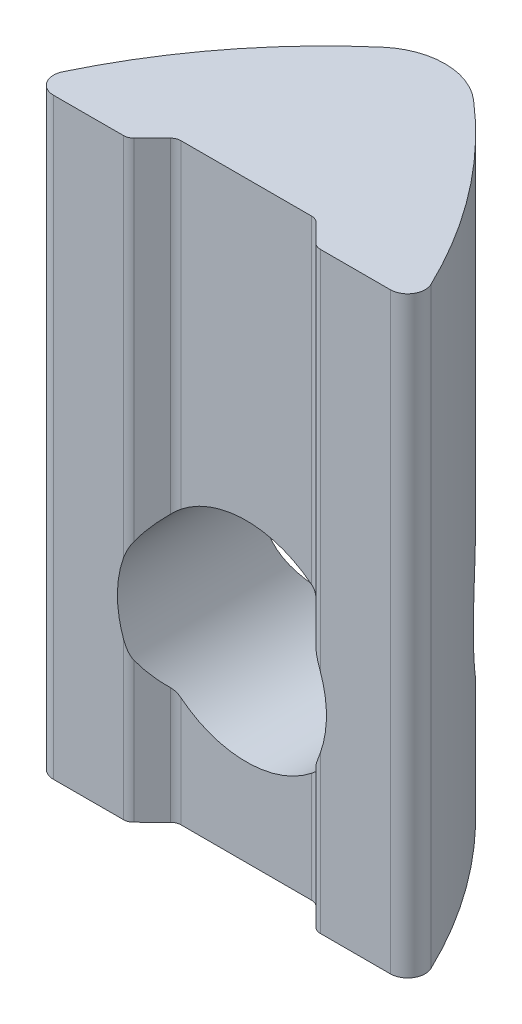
ISO-10303-21;
HEADER;
FILE_DESCRIPTION(('STEP AP214'),'2;1');
FILE_NAME('part.step','',(''),(''),'','','');
FILE_SCHEMA(('AUTOMOTIVE_DESIGN { 1 0 10303 214 1 1 1 1 }'));
ENDSEC;
DATA;
#1=APPLICATION_CONTEXT('core data for automotive mechanical design processes');
#2=APPLICATION_PROTOCOL_DEFINITION('international standard','automotive_design',2000,#1);
#3=PRODUCT_CONTEXT('',#1,'mechanical');
#4=PRODUCT('Part','Part','',(#3));
#5=PRODUCT_RELATED_PRODUCT_CATEGORY('part','',(#4));
#6=PRODUCT_DEFINITION_FORMATION('','',#4);
#7=PRODUCT_DEFINITION_CONTEXT('part definition',#1,'design');
#8=PRODUCT_DEFINITION('design','',#6,#7);
#9=PRODUCT_DEFINITION_SHAPE('','',#8);
#10=(LENGTH_UNIT() NAMED_UNIT(*) SI_UNIT(.MILLI.,.METRE.));
#11=(NAMED_UNIT(*) PLANE_ANGLE_UNIT() SI_UNIT($,.RADIAN.));
#12=(NAMED_UNIT(*) SI_UNIT($,.STERADIAN.) SOLID_ANGLE_UNIT());
#13=UNCERTAINTY_MEASURE_WITH_UNIT(LENGTH_MEASURE(1.E-05),#10,'distance_accuracy_value','');
#14=(GEOMETRIC_REPRESENTATION_CONTEXT(3) GLOBAL_UNCERTAINTY_ASSIGNED_CONTEXT((#13)) GLOBAL_UNIT_ASSIGNED_CONTEXT((#10,
#11,#12)) REPRESENTATION_CONTEXT('',''));
#15=CARTESIAN_POINT('',(0.,0.,0.));
#16=DIRECTION('',(0.,0.,1.));
#17=DIRECTION('',(1.,0.,0.));
#18=AXIS2_PLACEMENT_3D('',#15,#16,#17);
#19=CARTESIAN_POINT('',(-2.61216581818,11.5,-0.0902734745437));
#20=DIRECTION('',(0.70558446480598,0.,0.70862582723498));
#21=DIRECTION('',(0.70862582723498,0.,-0.70558446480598));
#22=AXIS2_PLACEMENT_3D('',#19,#20,#21);
#23=PLANE('',#22);
#24=DIRECTION('',(0.70862582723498,0.,-0.70558446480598));
#25=VECTOR('',#24,1.);
#26=CARTESIAN_POINT('',(-2.61216581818,11.5,-0.0902734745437));
#27=LINE('',#26,#25);
#28=CARTESIAN_POINT('',(-2.08760015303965,11.5,-0.612587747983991));
#29=VERTEX_POINT('',#28);
#30=CARTESIAN_POINT('',(-2.6121658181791,11.5,-0.0902734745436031));
#31=VERTEX_POINT('',#30);
#32=EDGE_CURVE('E184',#29,#31,#27,.F.);
#33=ORIENTED_EDGE('',*,*,#32,.T.);
#34=DIRECTION('',(0.,-1.,0.));
#35=VECTOR('',#34,1.);
#36=CARTESIAN_POINT('',(-2.61216581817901,11.5,-0.0902734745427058));
#37=LINE('',#36,#35);
#38=CARTESIAN_POINT('',(-2.61216581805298,1.47532699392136,-0.0902734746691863));
#39=VERTEX_POINT('',#38);
#40=EDGE_CURVE('E182',#39,#31,#37,.F.);
#41=ORIENTED_EDGE('',*,*,#40,.F.);
#42=CARTESIAN_POINT('',(0.,0.,-2.69122809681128));
#43=DIRECTION('',(0.70558446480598,0.,0.70862582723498));
#44=DIRECTION('',(-0.70862582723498,0.,0.70558446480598));
#45=AXIS2_PLACEMENT_3D('',#42,#43,#44);
#46=ELLIPSE('',#45,4.23354594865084,3.);
#47=CARTESIAN_POINT('',(-2.08760015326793,2.15451284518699,-0.612587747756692));
#48=VERTEX_POINT('',#47);
#49=EDGE_CURVE('E20',#39,#48,#46,.F.);
#50=ORIENTED_EDGE('',*,*,#49,.T.);
#51=DIRECTION('',(0.,-1.,0.));
#52=VECTOR('',#51,1.);
#53=CARTESIAN_POINT('',(-2.08760015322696,11.5,-0.612587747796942));
#54=LINE('',#53,#52);
#55=EDGE_CURVE('E179',#48,#29,#54,.F.);
#56=ORIENTED_EDGE('',*,*,#55,.T.);
#57=EDGE_LOOP('',(#33,#41,#50,#56));
#58=FACE_BOUND('',#57,.T.);
#59=ADVANCED_FACE('F17',(#58),#23,.T.);
#60=CARTESIAN_POINT('',(-2.61216581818,11.5,-0.0902734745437));
#61=DIRECTION('',(0.70558446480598,0.,0.70862582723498));
#62=DIRECTION('',(0.70862582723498,0.,-0.70558446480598));
#63=AXIS2_PLACEMENT_3D('',#60,#61,#62);
#64=PLANE('',#63);
#65=DIRECTION('',(0.70862582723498,0.,-0.70558446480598));
#66=VECTOR('',#65,1.);
#67=CARTESIAN_POINT('',(-2.61216581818,-5.5,-0.0902734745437));
#68=LINE('',#67,#66);
#69=CARTESIAN_POINT('',(-2.61216581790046,-5.5,-0.0902734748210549));
#70=VERTEX_POINT('',#69);
#71=CARTESIAN_POINT('',(-2.08760015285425,-5.5,-0.612587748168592));
#72=VERTEX_POINT('',#71);
#73=EDGE_CURVE('E378',#70,#72,#68,.T.);
#74=ORIENTED_EDGE('',*,*,#73,.T.);
#75=DIRECTION('',(0.,-1.,0.));
#76=VECTOR('',#75,1.);
#77=CARTESIAN_POINT('',(-2.08760015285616,11.5,-0.612587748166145));
#78=LINE('',#77,#76);
#79=CARTESIAN_POINT('',(-2.08760015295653,-2.15451284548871,-0.612587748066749));
#80=VERTEX_POINT('',#79);
#81=EDGE_CURVE('E460',#72,#80,#78,.F.);
#82=ORIENTED_EDGE('',*,*,#81,.T.);
#83=CARTESIAN_POINT('',(0.,0.,-2.69122809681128));
#84=DIRECTION('',(0.70558446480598,0.,0.70862582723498));
#85=DIRECTION('',(-0.70862582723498,0.,0.70558446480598));
#86=AXIS2_PLACEMENT_3D('',#83,#84,#85);
#87=ELLIPSE('',#86,4.23354594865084,3.);
#88=CARTESIAN_POINT('',(-2.61216581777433,-1.4753269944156,-0.0902734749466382));
#89=VERTEX_POINT('',#88);
#90=EDGE_CURVE('E381',#80,#89,#87,.F.);
#91=ORIENTED_EDGE('',*,*,#90,.T.);
#92=DIRECTION('',(0.,-1.,0.));
#93=VECTOR('',#92,1.);
#94=CARTESIAN_POINT('',(-2.61216581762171,11.5,-0.0902734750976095));
#95=LINE('',#94,#93);
#96=EDGE_CURVE('E453',#70,#89,#95,.F.);
#97=ORIENTED_EDGE('',*,*,#96,.F.);
#98=EDGE_LOOP('',(#74,#82,#91,#97));
#99=FACE_BOUND('',#98,.T.);
#100=ADVANCED_FACE('F477',(#99),#64,.T.);
#101=CARTESIAN_POINT('',(2.08805684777,11.5,-0.612132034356));
#102=DIRECTION('',(-0.707106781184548,0.,0.707106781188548));
#103=DIRECTION('',(0.707106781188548,0.,0.707106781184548));
#104=AXIS2_PLACEMENT_3D('',#101,#102,#103);
#105=PLANE('',#104);
#106=DIRECTION('',(0.707106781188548,0.,0.707106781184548));
#107=VECTOR('',#106,1.);
#108=CARTESIAN_POINT('',(2.08805684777,-5.5,-0.612132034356));
#109=LINE('',#108,#107);
#110=CARTESIAN_POINT('',(2.08805684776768,-5.5,-0.612132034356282));
#111=VERTEX_POINT('',#110);
#112=CARTESIAN_POINT('',(2.61232091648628,-5.5,-0.0878679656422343));
#113=VERTEX_POINT('',#112);
#114=EDGE_CURVE('E375',#111,#113,#109,.T.);
#115=ORIENTED_EDGE('',*,*,#114,.T.);
#116=DIRECTION('',(0.,-1.,0.));
#117=VECTOR('',#116,1.);
#118=CARTESIAN_POINT('',(2.61232091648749,11.5,-0.0878679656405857));
#119=LINE('',#118,#117);
#120=CARTESIAN_POINT('',(2.61232091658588,-1.47505234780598,-0.0878679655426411));
#121=VERTEX_POINT('',#120);
#122=EDGE_CURVE('E449',#121,#113,#119,.T.);
#123=ORIENTED_EDGE('',*,*,#122,.F.);
#124=CARTESIAN_POINT('',(0.,0.,-2.70018888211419));
#125=DIRECTION('',(-0.707106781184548,0.,0.707106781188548));
#126=DIRECTION('',(0.707106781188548,0.,0.707106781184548));
#127=AXIS2_PLACEMENT_3D('',#124,#125,#126);
#128=ELLIPSE('',#127,4.24264068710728,3.);
#129=CARTESIAN_POINT('',(2.08805684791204,-2.15407024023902,-0.612132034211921));
#130=VERTEX_POINT('',#129);
#131=EDGE_CURVE('E377',#121,#130,#128,.F.);
#132=ORIENTED_EDGE('',*,*,#131,.T.);
#133=DIRECTION('',(0.,-1.,0.));
#134=VECTOR('',#133,1.);
#135=CARTESIAN_POINT('',(2.08805684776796,11.5,-0.612132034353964));
#136=LINE('',#135,#134);
#137=EDGE_CURVE('E458',#130,#111,#136,.T.);
#138=ORIENTED_EDGE('',*,*,#137,.T.);
#139=EDGE_LOOP('',(#115,#123,#132,#138));
#140=FACE_BOUND('',#139,.T.);
#141=ADVANCED_FACE('F475',(#140),#105,.T.);
#142=CARTESIAN_POINT('',(2.08805684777,11.5,-0.612132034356));
#143=DIRECTION('',(-0.707106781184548,0.,0.707106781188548));
#144=DIRECTION('',(0.707106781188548,0.,0.707106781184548));
#145=AXIS2_PLACEMENT_3D('',#142,#143,#144);
#146=PLANE('',#145);
#147=DIRECTION('',(0.707106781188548,0.,0.707106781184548));
#148=VECTOR('',#147,1.);
#149=CARTESIAN_POINT('',(2.08805684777,11.5,-0.612132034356));
#150=LINE('',#149,#148);
#151=CARTESIAN_POINT('',(2.61232091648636,11.5,-0.0878679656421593));
#152=VERTEX_POINT('',#151);
#153=CARTESIAN_POINT('',(2.08805684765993,11.5,-0.612132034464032));
#154=VERTEX_POINT('',#153);
#155=EDGE_CURVE('E353',#152,#154,#150,.F.);
#156=ORIENTED_EDGE('',*,*,#155,.T.);
#157=DIRECTION('',(0.,-1.,0.));
#158=VECTOR('',#157,1.);
#159=CARTESIAN_POINT('',(2.08805684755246,11.5,-0.612132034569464));
#160=LINE('',#159,#158);
#161=CARTESIAN_POINT('',(2.08805684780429,2.15407024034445,-0.612132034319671));
#162=VERTEX_POINT('',#161);
#163=EDGE_CURVE('E360',#154,#162,#160,.T.);
#164=ORIENTED_EDGE('',*,*,#163,.T.);
#165=CARTESIAN_POINT('',(0.,0.,-2.70018888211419));
#166=DIRECTION('',(-0.707106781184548,0.,0.707106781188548));
#167=DIRECTION('',(0.707106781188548,0.,0.707106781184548));
#168=AXIS2_PLACEMENT_3D('',#165,#166,#167);
#169=ELLIPSE('',#168,4.24264068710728,3.);
#170=CARTESIAN_POINT('',(2.61232091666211,1.47505234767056,-0.0878679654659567));
#171=VERTEX_POINT('',#170);
#172=EDGE_CURVE('E370',#162,#171,#169,.F.);
#173=ORIENTED_EDGE('',*,*,#172,.T.);
#174=DIRECTION('',(0.,-1.,0.));
#175=VECTOR('',#174,1.);
#176=CARTESIAN_POINT('',(2.61232091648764,11.5,-0.0878679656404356));
#177=LINE('',#176,#175);
#178=EDGE_CURVE('E368',#152,#171,#177,.T.);
#179=ORIENTED_EDGE('',*,*,#178,.F.);
#180=EDGE_LOOP('',(#156,#164,#173,#179));
#181=FACE_BOUND('',#180,.T.);
#182=ADVANCED_FACE('F364',(#181),#146,.T.);
#183=CARTESIAN_POINT('',(1.87592481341,11.5,-0.4));
#184=DIRECTION('',(0.,-1.,0.));
#185=DIRECTION('',(0.,0.,-1.));
#186=AXIS2_PLACEMENT_3D('',#183,#184,#185);
#187=CYLINDRICAL_SURFACE('',#186,0.3);
#188=ORIENTED_EDGE('',*,*,#163,.F.);
#189=CARTESIAN_POINT('',(1.87592481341,11.5,-0.4));
#190=DIRECTION('',(0.,-1.,0.));
#191=DIRECTION('',(0.,0.,-1.));
#192=AXIS2_PLACEMENT_3D('',#189,#190,#191);
#193=CIRCLE('',#192,0.3);
#194=CARTESIAN_POINT('',(1.87592481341,11.5,-0.7));
#195=VERTEX_POINT('',#194);
#196=EDGE_CURVE('E351',#195,#154,#193,.T.);
#197=ORIENTED_EDGE('',*,*,#196,.F.);
#198=DIRECTION('',(0.,1.,0.));
#199=VECTOR('',#198,1.);
#200=CARTESIAN_POINT('',(1.87592481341,11.5,-0.7));
#201=LINE('',#200,#199);
#202=CARTESIAN_POINT('',(1.87592481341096,2.34113350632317,-0.6999999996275));
#203=VERTEX_POINT('',#202);
#204=EDGE_CURVE('E198',#203,#195,#201,.T.);
#205=ORIENTED_EDGE('',*,*,#204,.F.);
#206=CARTESIAN_POINT('',(2.0880568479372,2.15407024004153,-0.612132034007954));
#207=CARTESIAN_POINT('',(2.07296823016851,2.16871077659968,-0.627162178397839));
#208=CARTESIAN_POINT('',(2.05676984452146,2.1840914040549,-0.640217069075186));
#209=CARTESIAN_POINT('',(2.02304932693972,2.21534908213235,-0.662212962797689));
#210=CARTESIAN_POINT('',(2.00556719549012,2.23120600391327,-0.671243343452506));
#211=CARTESIAN_POINT('',(1.97000037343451,2.26266348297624,-0.685488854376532));
#212=CARTESIAN_POINT('',(1.95195306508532,2.27825591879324,-0.690817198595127));
#213=CARTESIAN_POINT('',(1.9146635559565,2.30969315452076,-0.698104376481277));
#214=CARTESIAN_POINT('',(1.89540333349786,2.32553539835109,-0.69998202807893));
#215=CARTESIAN_POINT('',(1.87592481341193,2.3411335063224,-0.7));
#216=B_SPLINE_CURVE_WITH_KNOTS('',3,(#206,#207,#208,#209,#210,#211,#212,#213,#214,#215),
.UNSPECIFIED.,.F.,.F.,(4,2,2,2,4),(0.,0.0773051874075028,0.152795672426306,0.225861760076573,
0.300625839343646),.UNSPECIFIED.);
#217=EDGE_CURVE('E192',#162,#203,#216,.T.);
#218=ORIENTED_EDGE('',*,*,#217,.F.);
#219=EDGE_LOOP('',(#188,#197,#205,#218));
#220=FACE_BOUND('',#219,.T.);
#221=ADVANCED_FACE('F323',(#220),#187,.F.);
#222=CARTESIAN_POINT('',(-1.87592481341,11.5,-0.4));
#223=DIRECTION('',(0.,-1.,0.));
#224=DIRECTION('',(0.,0.,-1.));
#225=AXIS2_PLACEMENT_3D('',#222,#223,#224);
#226=CYLINDRICAL_SURFACE('',#225,0.3);
#227=DIRECTION('',(0.,1.,0.));
#228=VECTOR('',#227,1.);
#229=CARTESIAN_POINT('',(-1.87592481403,11.5,-0.7));
#230=LINE('',#229,#228);
#231=CARTESIAN_POINT('',(-1.87592481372,11.5,-0.7));
#232=VERTEX_POINT('',#231);
#233=CARTESIAN_POINT('',(-1.87592481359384,2.34113350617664,-0.7));
#234=VERTEX_POINT('',#233);
#235=EDGE_CURVE('E202',#232,#234,#230,.F.);
#236=ORIENTED_EDGE('',*,*,#235,.F.);
#237=CARTESIAN_POINT('',(-1.87592481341,11.5,-0.4));
#238=DIRECTION('',(0.,-1.,0.));
#239=DIRECTION('',(0.,0.,-1.));
#240=AXIS2_PLACEMENT_3D('',#237,#238,#239);
#241=CIRCLE('',#240,0.3);
#242=EDGE_CURVE('E191',#29,#232,#241,.T.);
#243=ORIENTED_EDGE('',*,*,#242,.F.);
#244=ORIENTED_EDGE('',*,*,#55,.F.);
#245=CARTESIAN_POINT('',(-2.08760015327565,2.1545128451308,-0.612587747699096));
#246=CARTESIAN_POINT('',(-2.07248942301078,2.16916859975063,-0.627575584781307));
#247=CARTESIAN_POINT('',(-2.05627249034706,2.18455983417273,-0.640590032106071));
#248=CARTESIAN_POINT('',(-2.02251969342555,2.21583280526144,-0.662508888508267));
#249=CARTESIAN_POINT('',(-2.0050235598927,2.23169464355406,-0.6715023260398));
#250=CARTESIAN_POINT('',(-1.96952280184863,2.26307808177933,-0.685639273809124));
#251=CARTESIAN_POINT('',(-1.95156106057,2.27859050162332,-0.690913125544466));
#252=CARTESIAN_POINT('',(-1.91445824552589,2.30986190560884,-0.698124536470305));
#253=CARTESIAN_POINT('',(-1.89529953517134,2.32561833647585,-0.699982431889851));
#254=CARTESIAN_POINT('',(-1.87592481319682,2.34113350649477,-0.7));
#255=B_SPLINE_CURVE_WITH_KNOTS('',3,(#245,#246,#247,#248,#249,#250,#251,#252,#253,#254),
.UNSPECIFIED.,.F.,.F.,(4,2,2,2,4),(0.,0.0772980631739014,0.15278779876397,0.225479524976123,
0.299845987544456),.UNSPECIFIED.);
#256=EDGE_CURVE('E189',#48,#234,#255,.T.);
#257=ORIENTED_EDGE('',*,*,#256,.T.);
#258=EDGE_LOOP('',(#236,#243,#244,#257));
#259=FACE_BOUND('',#258,.T.);
#260=ADVANCED_FACE('F188',(#259),#226,.F.);
#261=CARTESIAN_POINT('',(-1.87592481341,11.5,-0.4));
#262=DIRECTION('',(0.,-1.,0.));
#263=DIRECTION('',(0.,0.,-1.));
#264=AXIS2_PLACEMENT_3D('',#261,#262,#263);
#265=CYLINDRICAL_SURFACE('',#264,0.3);
#266=ORIENTED_EDGE('',*,*,#81,.F.);
#267=CARTESIAN_POINT('',(-1.87592481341,-5.5,-0.4));
#268=DIRECTION('',(0.,-1.,0.));
#269=DIRECTION('',(0.,0.,-1.));
#270=AXIS2_PLACEMENT_3D('',#267,#268,#269);
#271=CIRCLE('',#270,0.3);
#272=CARTESIAN_POINT('',(-1.87592481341,-5.5,-0.7));
#273=VERTEX_POINT('',#272);
#274=EDGE_CURVE('E462',#273,#72,#271,.F.);
#275=ORIENTED_EDGE('',*,*,#274,.F.);
#276=DIRECTION('',(0.,1.,0.));
#277=VECTOR('',#276,1.);
#278=CARTESIAN_POINT('',(-1.87592481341,11.5,-0.7));
#279=LINE('',#278,#277);
#280=CARTESIAN_POINT('',(-1.87592481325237,-2.34113350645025,-0.6999999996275));
#281=VERTEX_POINT('',#280);
#282=EDGE_CURVE('E444',#281,#273,#279,.F.);
#283=ORIENTED_EDGE('',*,*,#282,.F.);
#284=CARTESIAN_POINT('',(-1.87592481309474,-2.34113350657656,-0.7));
#285=CARTESIAN_POINT('',(-1.89598624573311,-2.32507000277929,-0.699979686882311));
#286=CARTESIAN_POINT('',(-1.91581783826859,-2.3087441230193,-0.697988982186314));
#287=CARTESIAN_POINT('',(-1.95416475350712,-2.27636609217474,-0.690266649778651));
#288=CARTESIAN_POINT('',(-1.97269999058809,-2.26031644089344,-0.684623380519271));
#289=CARTESIAN_POINT('',(-2.00803859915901,-2.22897312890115,-0.670002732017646));
#290=CARTESIAN_POINT('',(-2.02487702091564,-2.21367116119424,-0.661129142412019));
#291=CARTESIAN_POINT('',(-2.0573790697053,-2.18350817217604,-0.639701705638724));
#292=CARTESIAN_POINT('',(-2.07300638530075,-2.16866561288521,-0.627067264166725));
#293=CARTESIAN_POINT('',(-2.08760015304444,-2.15451284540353,-0.612587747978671));
#294=B_SPLINE_CURVE_WITH_KNOTS('',3,(#284,#285,#286,#287,#288,#289,#290,#291,#292,#293),
.UNSPECIFIED.,.F.,.F.,(4,2,2,2,4),(0.,0.0770007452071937,0.152205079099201,0.225180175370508,
0.299848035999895),.UNSPECIFIED.);
#295=EDGE_CURVE('E260',#281,#80,#294,.T.);
#296=ORIENTED_EDGE('',*,*,#295,.T.);
#297=EDGE_LOOP('',(#266,#275,#283,#296));
#298=FACE_BOUND('',#297,.T.);
#299=ADVANCED_FACE('F313',(#298),#265,.F.);
#300=CARTESIAN_POINT('',(1.87592481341,11.5,-0.4));
#301=DIRECTION('',(0.,-1.,0.));
#302=DIRECTION('',(0.,0.,-1.));
#303=AXIS2_PLACEMENT_3D('',#300,#301,#302);
#304=CYLINDRICAL_SURFACE('',#303,0.3);
#305=DIRECTION('',(0.,1.,0.));
#306=VECTOR('',#305,1.);
#307=CARTESIAN_POINT('',(1.87592481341,11.5,-0.7));
#308=LINE('',#307,#306);
#309=CARTESIAN_POINT('',(1.87592481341,-5.5,-0.7));
#310=VERTEX_POINT('',#309);
#311=CARTESIAN_POINT('',(1.87592481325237,-2.34113350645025,-0.7));
#312=VERTEX_POINT('',#311);
#313=EDGE_CURVE('E442',#310,#312,#308,.T.);
#314=ORIENTED_EDGE('',*,*,#313,.F.);
#315=CARTESIAN_POINT('',(1.87592481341,-5.5,-0.4));
#316=DIRECTION('',(0.,-1.,0.));
#317=DIRECTION('',(0.,0.,-1.));
#318=AXIS2_PLACEMENT_3D('',#315,#316,#317);
#319=CIRCLE('',#318,0.3);
#320=EDGE_CURVE('E306',#111,#310,#319,.F.);
#321=ORIENTED_EDGE('',*,*,#320,.F.);
#322=ORIENTED_EDGE('',*,*,#137,.F.);
#323=CARTESIAN_POINT('',(1.87592481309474,-2.34113350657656,-0.7));
#324=CARTESIAN_POINT('',(1.8959871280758,-2.32506925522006,-0.699979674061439));
#325=CARTESIAN_POINT('',(1.91581936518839,-2.3087428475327,-0.69798882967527));
#326=CARTESIAN_POINT('',(1.95416607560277,-2.27636496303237,-0.690266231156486));
#327=CARTESIAN_POINT('',(1.97270052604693,-2.26031599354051,-0.684623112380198));
#328=CARTESIAN_POINT('',(2.0081289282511,-2.22889298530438,-0.66996540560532));
#329=CARTESIAN_POINT('',(2.0250520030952,-2.21351205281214,-0.661037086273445));
#330=CARTESIAN_POINT('',(2.05770960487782,-2.18319791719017,-0.639459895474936));
#331=CARTESIAN_POINT('',(2.07340706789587,-2.16828360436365,-0.62672887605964));
#332=CARTESIAN_POINT('',(2.08805684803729,-2.1540702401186,-0.612132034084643));
#333=B_SPLINE_CURVE_WITH_KNOTS('',3,(#323,#324,#325,#326,#327,#328,#329,#330,#331,#332),
.UNSPECIFIED.,.F.,.F.,(4,2,2,2,4),(0.,0.0770035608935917,0.152205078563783,0.225558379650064,
0.300627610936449),.UNSPECIFIED.);
#334=EDGE_CURVE('E298',#312,#130,#333,.T.);
#335=ORIENTED_EDGE('',*,*,#334,.F.);
#336=EDGE_LOOP('',(#314,#321,#322,#335));
#337=FACE_BOUND('',#336,.T.);
#338=ADVANCED_FACE('F309',(#337),#304,.F.);
#339=CARTESIAN_POINT('',(-2.82384115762,11.5,-0.302861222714));
#340=DIRECTION('',(0.,-1.,0.));
#341=DIRECTION('',(0.,0.,-1.));
#342=AXIS2_PLACEMENT_3D('',#339,#340,#341);
#343=CYLINDRICAL_SURFACE('',#342,0.3);
#344=CARTESIAN_POINT('',(-2.82384115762,11.5,-0.302861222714));
#345=DIRECTION('',(0.,-1.,0.));
#346=DIRECTION('',(0.,0.,-1.));
#347=AXIS2_PLACEMENT_3D('',#344,#345,#346);
#348=CIRCLE('',#347,0.3);
#349=CARTESIAN_POINT('',(-2.82349450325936,11.5,-0.0028614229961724));
#350=VERTEX_POINT('',#349);
#351=EDGE_CURVE('E307',#31,#350,#348,.T.);
#352=ORIENTED_EDGE('',*,*,#351,.T.);
#353=DIRECTION('',(0.,1.,0.));
#354=VECTOR('',#353,1.);
#355=CARTESIAN_POINT('',(-2.82349450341,11.5,-0.00286142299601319));
#356=LINE('',#355,#354);
#357=CARTESIAN_POINT('',(-2.82349450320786,1.01384357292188,-0.0028614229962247));
#358=VERTEX_POINT('',#357);
#359=EDGE_CURVE('E436',#358,#350,#356,.T.);
#360=ORIENTED_EDGE('',*,*,#359,.F.);
#361=CARTESIAN_POINT('',(-2.82349450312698,1.01384357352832,-0.00286142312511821));
#362=CARTESIAN_POINT('',(-2.81321153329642,1.04248698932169,-0.00288617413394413));
#363=CARTESIAN_POINT('',(-2.80248354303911,1.07098764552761,-0.00341621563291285));
#364=CARTESIAN_POINT('',(-2.78015253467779,1.12768795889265,-0.00584248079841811));
#365=CARTESIAN_POINT('',(-2.76854682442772,1.15588635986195,-0.00774307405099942));
#366=CARTESIAN_POINT('',(-2.74480994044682,1.21115771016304,-0.013208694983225));
#367=CARTESIAN_POINT('',(-2.73269629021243,1.23824172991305,-0.0167356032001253));
#368=CARTESIAN_POINT('',(-2.7078262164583,1.29172168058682,-0.0258839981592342));
#369=CARTESIAN_POINT('',(-2.69507066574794,1.31811847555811,-0.0315027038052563));
#370=CARTESIAN_POINT('',(-2.67067417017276,1.36680149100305,-0.0445835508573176));
#371=CARTESIAN_POINT('',(-2.6590880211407,1.38919523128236,-0.05173568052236));
#372=CARTESIAN_POINT('',(-2.64156188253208,1.42207855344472,-0.0644771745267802));
#373=CARTESIAN_POINT('',(-2.63566702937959,1.4329717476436,-0.069086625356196));
#374=CARTESIAN_POINT('',(-2.62389138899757,1.45442244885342,-0.0790772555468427));
#375=CARTESIAN_POINT('',(-2.61801062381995,1.46497958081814,-0.084459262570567));
#376=CARTESIAN_POINT('',(-2.61216581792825,1.47532699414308,-0.0902734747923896));
#377=B_SPLINE_CURVE_WITH_KNOTS('',3,(#361,#362,#363,#364,#365,#366,#367,#368,#369,#370,#371,
#372,#373,#374,#375,#376),.UNSPECIFIED.,.F.,.F.,(4,2,2,2,2,2,2,4),(0.,0.0913170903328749,
0.182926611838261,0.272490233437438,0.361935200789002,0.440426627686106,0.480050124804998,
0.519716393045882),.UNSPECIFIED.);
#378=EDGE_CURVE('E199',#358,#39,#377,.T.);
#379=ORIENTED_EDGE('',*,*,#378,.T.);
#380=ORIENTED_EDGE('',*,*,#40,.T.);
#381=EDGE_LOOP('',(#352,#360,#379,#380));
#382=FACE_BOUND('',#381,.T.);
#383=ADVANCED_FACE('F312',(#382),#343,.T.);
#384=CARTESIAN_POINT('',(-2.82384115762,11.5,-0.302861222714));
#385=DIRECTION('',(0.,-1.,0.));
#386=DIRECTION('',(0.,0.,-1.));
#387=AXIS2_PLACEMENT_3D('',#384,#385,#386);
#388=CYLINDRICAL_SURFACE('',#387,0.3);
#389=CARTESIAN_POINT('',(-2.82384115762,-5.5,-0.302861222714));
#390=DIRECTION('',(0.,-1.,0.));
#391=DIRECTION('',(0.,0.,-1.));
#392=AXIS2_PLACEMENT_3D('',#389,#390,#391);
#393=CIRCLE('',#392,0.3);
#394=CARTESIAN_POINT('',(-2.82349450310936,-5.5,-0.00286142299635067));
#395=VERTEX_POINT('',#394);
#396=EDGE_CURVE('E456',#395,#70,#393,.F.);
#397=ORIENTED_EDGE('',*,*,#396,.T.);
#398=ORIENTED_EDGE('',*,*,#96,.T.);
#399=CARTESIAN_POINT('',(-2.61216581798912,-1.47532699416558,-0.0902734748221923));
#400=CARTESIAN_POINT('',(-2.6208739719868,-1.45991473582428,-0.0816294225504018));
#401=CARTESIAN_POINT('',(-2.62964789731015,-1.44405555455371,-0.0739274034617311));
#402=CARTESIAN_POINT('',(-2.64716488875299,-1.41168372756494,-0.0601428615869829));
#403=CARTESIAN_POINT('',(-2.65590797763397,-1.39517278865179,-0.0540563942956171));
#404=CARTESIAN_POINT('',(-2.67313989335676,-1.36186344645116,-0.0432645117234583));
#405=CARTESIAN_POINT('',(-2.68163051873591,-1.34507097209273,-0.0385432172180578));
#406=CARTESIAN_POINT('',(-2.69840049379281,-1.31110415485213,-0.0301850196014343));
#407=CARTESIAN_POINT('',(-2.70667969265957,-1.29392955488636,-0.0265488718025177));
#408=CARTESIAN_POINT('',(-2.73464533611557,-1.23445497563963,-0.0156338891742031));
#409=CARTESIAN_POINT('',(-2.75367394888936,-1.19142438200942,-0.0106036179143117));
#410=CARTESIAN_POINT('',(-2.78086104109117,-1.12578350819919,-0.00581281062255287));
#411=CARTESIAN_POINT('',(-2.7897607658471,-1.10354459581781,-0.00467718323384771));
#412=CARTESIAN_POINT('',(-2.80702768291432,-1.0588520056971,-0.00320764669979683));
#413=CARTESIAN_POINT('',(-2.81539524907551,-1.03639849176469,-0.00287316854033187));
#414=CARTESIAN_POINT('',(-2.82349450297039,-1.01384357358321,-0.00286142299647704));
#415=B_SPLINE_CURVE_WITH_KNOTS('',3,(#399,#400,#401,#402,#403,#404,#405,#406,#407,#408,#409,
#410,#411,#412,#413,#414),.UNSPECIFIED.,.F.,.F.,(4,2,2,2,2,2,2,4),(0.,0.0590224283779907,
0.117899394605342,0.176061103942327,0.234263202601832,0.375883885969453,0.447814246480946,
0.519693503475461),.UNSPECIFIED.);
#416=CARTESIAN_POINT('',(-2.8234945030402,-1.01384357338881,-0.00286142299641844));
#417=VERTEX_POINT('',#416);
#418=EDGE_CURVE('E204',#89,#417,#415,.T.);
#419=ORIENTED_EDGE('',*,*,#418,.T.);
#420=DIRECTION('',(0.,1.,0.));
#421=VECTOR('',#420,1.);
#422=CARTESIAN_POINT('',(-2.82349450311,11.5,-0.00286142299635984));
#423=LINE('',#422,#421);
#424=EDGE_CURVE('E428',#395,#417,#423,.T.);
#425=ORIENTED_EDGE('',*,*,#424,.F.);
#426=EDGE_LOOP('',(#397,#398,#419,#425));
#427=FACE_BOUND('',#426,.T.);
#428=ADVANCED_FACE('F542',(#427),#388,.T.);
#429=CARTESIAN_POINT('',(2.82445295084,11.5,-0.3));
#430=DIRECTION('',(0.,-1.,0.));
#431=DIRECTION('',(0.,0.,-1.));
#432=AXIS2_PLACEMENT_3D('',#429,#430,#431);
#433=CYLINDRICAL_SURFACE('',#432,0.3);
#434=CARTESIAN_POINT('',(2.82445295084,-5.5,-0.3));
#435=DIRECTION('',(0.,-1.,0.));
#436=DIRECTION('',(0.,0.,-1.));
#437=AXIS2_PLACEMENT_3D('',#434,#435,#436);
#438=CIRCLE('',#437,0.3);
#439=CARTESIAN_POINT('',(2.82445295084,-5.5,3.00493127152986E-13));
#440=VERTEX_POINT('',#439);
#441=EDGE_CURVE('E452',#113,#440,#438,.F.);
#442=ORIENTED_EDGE('',*,*,#441,.T.);
#443=DIRECTION('',(0.,1.,0.));
#444=VECTOR('',#443,1.);
#445=CARTESIAN_POINT('',(2.82445295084,11.5,3.00349981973E-13));
#446=LINE('',#445,#444);
#447=CARTESIAN_POINT('',(2.8244529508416,-1.01117037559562,1.50476194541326E-13));
#448=VERTEX_POINT('',#447);
#449=EDGE_CURVE('E425',#448,#440,#446,.F.);
#450=ORIENTED_EDGE('',*,*,#449,.F.);
#451=CARTESIAN_POINT('',(2.8244529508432,-1.01117037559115,0.));
#452=CARTESIAN_POINT('',(2.81419029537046,-1.03984245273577,-1.27975631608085E-05));
#453=CARTESIAN_POINT('',(2.8034819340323,-1.06837203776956,-0.000528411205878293));
#454=CARTESIAN_POINT('',(2.78118879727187,-1.12513036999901,-0.00291994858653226));
#455=CARTESIAN_POINT('',(2.7696013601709,-1.15335788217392,-0.00480016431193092));
#456=CARTESIAN_POINT('',(2.74589849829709,-1.20868821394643,-0.0102187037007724));
#457=CARTESIAN_POINT('',(2.73380067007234,-1.23580206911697,-0.013719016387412));
#458=CARTESIAN_POINT('',(2.70895879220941,-1.28934534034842,-0.0228063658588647));
#459=CARTESIAN_POINT('',(2.69621560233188,-1.31577559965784,-0.0283906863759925));
#460=CARTESIAN_POINT('',(2.67167213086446,-1.36485710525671,-0.0414853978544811));
#461=CARTESIAN_POINT('',(2.65992188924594,-1.38760470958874,-0.0487170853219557));
#462=CARTESIAN_POINT('',(2.64214350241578,-1.42099935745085,-0.06163584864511));
#463=CARTESIAN_POINT('',(2.63616267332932,-1.4320612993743,-0.0663149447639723));
#464=CARTESIAN_POINT('',(2.62421564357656,-1.45383890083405,-0.0764692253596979));
#465=CARTESIAN_POINT('',(2.61824946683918,-1.46455415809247,-0.0819452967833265));
#466=CARTESIAN_POINT('',(2.6123209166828,-1.47505234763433,-0.0878679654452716));
#467=B_SPLINE_CURVE_WITH_KNOTS('',3,(#451,#452,#453,#454,#455,#456,#457,#458,#459,#460,#461,
#462,#463,#464,#465,#466),.UNSPECIFIED.,.F.,.F.,(4,2,2,2,2,2,2,4),(0.,0.0913772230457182,
0.183043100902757,0.272659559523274,0.362159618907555,0.441835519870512,0.482063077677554,
0.522335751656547),.UNSPECIFIED.);
#468=EDGE_CURVE('E291',#448,#121,#467,.T.);
#469=ORIENTED_EDGE('',*,*,#468,.T.);
#470=ORIENTED_EDGE('',*,*,#122,.T.);
#471=EDGE_LOOP('',(#442,#450,#469,#470));
#472=FACE_BOUND('',#471,.T.);
#473=ADVANCED_FACE('F499',(#472),#433,.T.);
#474=CARTESIAN_POINT('',(2.82445295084,11.5,-0.3));
#475=DIRECTION('',(0.,-1.,0.));
#476=DIRECTION('',(0.,0.,-1.));
#477=AXIS2_PLACEMENT_3D('',#474,#475,#476);
#478=CYLINDRICAL_SURFACE('',#477,0.3);
#479=CARTESIAN_POINT('',(2.82445295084,11.5,-0.3));
#480=DIRECTION('',(0.,-1.,0.));
#481=DIRECTION('',(0.,0.,-1.));
#482=AXIS2_PLACEMENT_3D('',#479,#480,#481);
#483=CIRCLE('',#482,0.3);
#484=CARTESIAN_POINT('',(2.824452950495,11.5,3.0064926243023E-13));
#485=VERTEX_POINT('',#484);
#486=EDGE_CURVE('E448',#485,#152,#483,.T.);
#487=ORIENTED_EDGE('',*,*,#486,.T.);
#488=ORIENTED_EDGE('',*,*,#178,.T.);
#489=CARTESIAN_POINT('',(2.61232091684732,1.4750523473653,-0.0878679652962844));
#490=CARTESIAN_POINT('',(2.62099727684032,1.45969258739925,-0.079218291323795));
#491=CARTESIAN_POINT('',(2.62974068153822,1.44388580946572,-0.0715082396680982));
#492=CARTESIAN_POINT('',(2.64719920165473,1.41161861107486,-0.0577038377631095));
#493=CARTESIAN_POINT('',(2.65591433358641,1.39515990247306,-0.0516055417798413));
#494=CARTESIAN_POINT('',(2.67309285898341,1.36195495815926,-0.0407874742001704));
#495=CARTESIAN_POINT('',(2.68155802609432,1.34521467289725,-0.0360518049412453));
#496=CARTESIAN_POINT('',(2.6982795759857,1.31135216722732,-0.0276625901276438));
#497=CARTESIAN_POINT('',(2.70653580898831,1.29422968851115,-0.024009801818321));
#498=CARTESIAN_POINT('',(2.73470354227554,1.23434539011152,-0.0129252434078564));
#499=CARTESIAN_POINT('',(2.75394091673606,1.19082808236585,-0.00781318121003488));
#500=CARTESIAN_POINT('',(2.78141046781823,1.12443139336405,-0.00295761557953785));
#501=CARTESIAN_POINT('',(2.7904009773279,1.1019308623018,-0.00181024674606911));
#502=CARTESIAN_POINT('',(2.80783657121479,1.05671138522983,-0.000332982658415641));
#503=CARTESIAN_POINT('',(2.81628206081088,1.03399261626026,-2.47309311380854E-06));
#504=CARTESIAN_POINT('',(2.82445295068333,1.01117037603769,0.));
#505=B_SPLINE_CURVE_WITH_KNOTS('',3,(#489,#490,#491,#492,#493,#494,#495,#496,#497,#498,#499,
#500,#501,#502,#503,#504),.UNSPECIFIED.,.F.,.F.,(4,2,2,2,2,2,2,4),(0.,0.0588646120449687,
0.117583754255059,0.175587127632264,0.233630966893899,0.37684476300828,0.449605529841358,
0.522311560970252),.UNSPECIFIED.);
#506=CARTESIAN_POINT('',(2.82445295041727,1.01117037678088,1.50485863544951E-13));
#507=VERTEX_POINT('',#506);
#508=EDGE_CURVE('E283',#171,#507,#505,.T.);
#509=ORIENTED_EDGE('',*,*,#508,.T.);
#510=DIRECTION('',(0.,1.,0.));
#511=VECTOR('',#510,1.);
#512=CARTESIAN_POINT('',(2.82445295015,11.5,3.00349981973E-13));
#513=LINE('',#512,#511);
#514=EDGE_CURVE('E422',#485,#507,#513,.F.);
#515=ORIENTED_EDGE('',*,*,#514,.F.);
#516=EDGE_LOOP('',(#487,#488,#509,#515));
#517=FACE_BOUND('',#516,.T.);
#518=ADVANCED_FACE('F529',(#517),#478,.T.);
#519=CARTESIAN_POINT('',(-4.83092848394,11.5,-0.5005421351));
#520=DIRECTION('',(0.,-1.,0.));
#521=DIRECTION('',(0.,0.,-1.));
#522=AXIS2_PLACEMENT_3D('',#519,#520,#521);
#523=CYLINDRICAL_SURFACE('',#522,0.5);
#524=CARTESIAN_POINT('',(-4.83092848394,11.5,-0.5005421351));
#525=DIRECTION('',(0.,-1.,0.));
#526=DIRECTION('',(0.,0.,-1.));
#527=AXIS2_PLACEMENT_3D('',#524,#525,#526);
#528=CIRCLE('',#527,0.5);
#529=CARTESIAN_POINT('',(-4.8303507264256,11.5,-0.000542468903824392));
#530=VERTEX_POINT('',#529);
#531=CARTESIAN_POINT('',(-5.2818009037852,11.5,-0.716676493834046));
#532=VERTEX_POINT('',#531);
#533=EDGE_CURVE('E489',#530,#532,#528,.T.);
#534=ORIENTED_EDGE('',*,*,#533,.T.);
#535=DIRECTION('',(0.,-1.,0.));
#536=VECTOR('',#535,1.);
#537=CARTESIAN_POINT('',(-5.28180090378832,11.5,-0.716676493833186));
#538=LINE('',#537,#536);
#539=CARTESIAN_POINT('',(-5.2818009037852,-5.5,-0.716676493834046));
#540=VERTEX_POINT('',#539);
#541=EDGE_CURVE('E430',#540,#532,#538,.F.);
#542=ORIENTED_EDGE('',*,*,#541,.F.);
#543=CARTESIAN_POINT('',(-4.83092848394,-5.5,-0.5005421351));
#544=DIRECTION('',(0.,-1.,0.));
#545=DIRECTION('',(0.,0.,-1.));
#546=AXIS2_PLACEMENT_3D('',#543,#544,#545);
#547=CIRCLE('',#546,0.5);
#548=CARTESIAN_POINT('',(-4.8303507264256,-5.5,-0.000542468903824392));
#549=VERTEX_POINT('',#548);
#550=EDGE_CURVE('E447',#540,#549,#547,.F.);
#551=ORIENTED_EDGE('',*,*,#550,.T.);
#552=DIRECTION('',(0.,1.,0.));
#553=VECTOR('',#552,1.);
#554=CARTESIAN_POINT('',(-4.83035072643,11.5,-0.00054246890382));
#555=LINE('',#554,#553);
#556=EDGE_CURVE('E435',#530,#549,#555,.F.);
#557=ORIENTED_EDGE('',*,*,#556,.F.);
#558=EDGE_LOOP('',(#534,#542,#551,#557));
#559=FACE_BOUND('',#558,.T.);
#560=ADVANCED_FACE('F526',(#559),#523,.T.);
#561=CARTESIAN_POINT('',(-1.87592481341,11.5,-0.7));
#562=DIRECTION('',(0.,0.,1.));
#563=DIRECTION('',(1.,0.,0.));
#564=AXIS2_PLACEMENT_3D('',#561,#562,#563);
#565=PLANE('',#564);
#566=DIRECTION('',(1.,0.,0.));
#567=VECTOR('',#566,1.);
#568=CARTESIAN_POINT('',(0.000506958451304,11.5,-0.7));
#569=LINE('',#568,#567);
#570=EDGE_CURVE('E356',#195,#232,#569,.F.);
#571=ORIENTED_EDGE('',*,*,#570,.T.);
#572=ORIENTED_EDGE('',*,*,#235,.T.);
#573=CARTESIAN_POINT('',(0.,0.,-0.699999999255));
#574=DIRECTION('',(0.,0.,1.));
#575=DIRECTION('',(1.,0.,0.));
#576=AXIS2_PLACEMENT_3D('',#573,#574,#575);
#577=CIRCLE('',#576,3.);
#578=EDGE_CURVE('E197',#234,#203,#577,.F.);
#579=ORIENTED_EDGE('',*,*,#578,.T.);
#580=ORIENTED_EDGE('',*,*,#204,.T.);
#581=EDGE_LOOP('',(#571,#572,#579,#580));
#582=FACE_BOUND('',#581,.T.);
#583=ADVANCED_FACE('F528',(#582),#565,.T.);
#584=CARTESIAN_POINT('',(-1.87592481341,11.5,-0.7));
#585=DIRECTION('',(0.,0.,1.));
#586=DIRECTION('',(1.,0.,0.));
#587=AXIS2_PLACEMENT_3D('',#584,#585,#586);
#588=PLANE('',#587);
#589=DIRECTION('',(1.,0.,0.));
#590=VECTOR('',#589,1.);
#591=CARTESIAN_POINT('',(0.000506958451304,-5.5,-0.7));
#592=LINE('',#591,#590);
#593=EDGE_CURVE('E405',#310,#273,#592,.F.);
#594=ORIENTED_EDGE('',*,*,#593,.F.);
#595=ORIENTED_EDGE('',*,*,#313,.T.);
#596=CARTESIAN_POINT('',(0.,0.,-0.7));
#597=DIRECTION('',(0.,0.,1.));
#598=DIRECTION('',(1.,0.,0.));
#599=AXIS2_PLACEMENT_3D('',#596,#597,#598);
#600=CIRCLE('',#599,3.);
#601=EDGE_CURVE('E561',#312,#281,#600,.F.);
#602=ORIENTED_EDGE('',*,*,#601,.T.);
#603=ORIENTED_EDGE('',*,*,#282,.T.);
#604=EDGE_LOOP('',(#594,#595,#602,#603));
#605=FACE_BOUND('',#604,.T.);
#606=ADVANCED_FACE('F535',(#605),#588,.T.);
#607=CARTESIAN_POINT('',(-4.83035072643,11.5,-0.00054246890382));
#608=DIRECTION('',(0.00115551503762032,0.,0.999999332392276));
#609=DIRECTION('',(0.999999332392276,0.,-0.00115551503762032));
#610=AXIS2_PLACEMENT_3D('',#607,#608,#609);
#611=PLANE('',#610);
#612=DIRECTION('',(-0.999999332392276,0.,0.00115551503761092));
#613=VECTOR('',#612,1.);
#614=CARTESIAN_POINT('',(-2.82349450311,-5.5,-0.00286142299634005));
#615=LINE('',#614,#613);
#616=EDGE_CURVE('E401',#395,#549,#615,.T.);
#617=ORIENTED_EDGE('',*,*,#616,.F.);
#618=ORIENTED_EDGE('',*,*,#424,.T.);
#619=CARTESIAN_POINT('',(0.,0.,-0.00612401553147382));
#620=DIRECTION('',(0.00115551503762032,0.,0.999999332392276));
#621=DIRECTION('',(-0.999999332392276,0.,0.00115551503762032));
#622=AXIS2_PLACEMENT_3D('',#619,#620,#621);
#623=ELLIPSE('',#622,3.00000200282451,3.);
#624=EDGE_CURVE('E439',#417,#358,#623,.F.);
#625=ORIENTED_EDGE('',*,*,#624,.T.);
#626=ORIENTED_EDGE('',*,*,#359,.T.);
#627=DIRECTION('',(-0.999999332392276,0.,0.00115551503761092));
#628=VECTOR('',#627,1.);
#629=CARTESIAN_POINT('',(-2.82349450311,11.5,-0.00286142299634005));
#630=LINE('',#629,#628);
#631=EDGE_CURVE('E415',#350,#530,#630,.T.);
#632=ORIENTED_EDGE('',*,*,#631,.T.);
#633=ORIENTED_EDGE('',*,*,#556,.T.);
#634=EDGE_LOOP('',(#617,#618,#625,#626,#632,#633));
#635=FACE_BOUND('',#634,.T.);
#636=ADVANCED_FACE('F557',(#635),#611,.T.);
#637=CARTESIAN_POINT('',(2.82445295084,11.5,3.00349981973E-13));
#638=DIRECTION('',(0.,0.,1.));
#639=DIRECTION('',(1.,0.,0.));
#640=AXIS2_PLACEMENT_3D('',#637,#638,#639);
#641=PLANE('',#640);
#642=DIRECTION('',(1.,0.,0.));
#643=VECTOR('',#642,1.);
#644=CARTESIAN_POINT('',(0.000506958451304,11.5,3.00974523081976E-13));
#645=LINE('',#644,#643);
#646=CARTESIAN_POINT('',(4.83156611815,11.5,1.50487261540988E-13));
#647=VERTEX_POINT('',#646);
#648=EDGE_CURVE('E411',#647,#485,#645,.F.);
#649=ORIENTED_EDGE('',*,*,#648,.T.);
#650=ORIENTED_EDGE('',*,*,#514,.T.);
#651=CARTESIAN_POINT('',(0.,0.,3.00974523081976E-13));
#652=DIRECTION('',(0.,0.,1.));
#653=DIRECTION('',(1.,0.,0.));
#654=AXIS2_PLACEMENT_3D('',#651,#652,#653);
#655=CIRCLE('',#654,3.);
#656=EDGE_CURVE('E509',#507,#448,#655,.F.);
#657=ORIENTED_EDGE('',*,*,#656,.T.);
#658=ORIENTED_EDGE('',*,*,#449,.T.);
#659=DIRECTION('',(1.,0.,0.));
#660=VECTOR('',#659,1.);
#661=CARTESIAN_POINT('',(0.000506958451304,-5.5,3.00974523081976E-13));
#662=LINE('',#661,#660);
#663=CARTESIAN_POINT('',(4.83156611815,-5.5,1.50487261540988E-13));
#664=VERTEX_POINT('',#663);
#665=EDGE_CURVE('E397',#664,#440,#662,.F.);
#666=ORIENTED_EDGE('',*,*,#665,.F.);
#667=DIRECTION('',(0.,-1.,0.));
#668=VECTOR('',#667,1.);
#669=CARTESIAN_POINT('',(4.83156611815,11.5,0.));
#670=LINE('',#669,#668);
#671=EDGE_CURVE('E407',#647,#664,#670,.T.);
#672=ORIENTED_EDGE('',*,*,#671,.F.);
#673=EDGE_LOOP('',(#649,#650,#657,#658,#666,#672));
#674=FACE_BOUND('',#673,.T.);
#675=ADVANCED_FACE('F505',(#674),#641,.T.);
#676=CARTESIAN_POINT('',(9.14611653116,11.5,6.19962298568));
#677=DIRECTION('',(0.,-1.,0.));
#678=DIRECTION('',(0.,0.,-1.));
#679=AXIS2_PLACEMENT_3D('',#676,#677,#678);
#680=CYLINDRICAL_SURFACE('',#679,16.);
#681=CARTESIAN_POINT('',(9.14611653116,11.5,6.19962298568));
#682=DIRECTION('',(0.,-1.,0.));
#683=DIRECTION('',(0.,0.,-1.));
#684=AXIS2_PLACEMENT_3D('',#681,#682,#683);
#685=CIRCLE('',#684,16.);
#686=CARTESIAN_POINT('',(-1.3063722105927,11.5,-5.91423185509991));
#687=VERTEX_POINT('',#686);
#688=EDGE_CURVE('E418',#532,#687,#685,.T.);
#689=ORIENTED_EDGE('',*,*,#688,.T.);
#690=DIRECTION('',(0.,-1.,0.));
#691=VECTOR('',#690,1.);
#692=CARTESIAN_POINT('',(-1.30637221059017,11.5,-5.9142318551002));
#693=LINE('',#692,#691);
#694=CARTESIAN_POINT('',(-1.30637221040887,2.70062800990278,-5.91423185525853));
#695=VERTEX_POINT('',#694);
#696=EDGE_CURVE('E419',#695,#687,#693,.F.);
#697=ORIENTED_EDGE('',*,*,#696,.F.);
#698=CARTESIAN_POINT('',(-1.30637221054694,2.70062801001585,-5.91423185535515));
#699=CARTESIAN_POINT('',(-1.39314141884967,2.65863152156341,-5.83937561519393));
#700=CARTESIAN_POINT('',(-1.47795069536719,2.61246778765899,-5.76455865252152));
#701=CARTESIAN_POINT('',(-1.64333299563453,2.51174807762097,-5.61562556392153));
#702=CARTESIAN_POINT('',(-1.72390002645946,2.45718063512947,-5.5415105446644));
#703=CARTESIAN_POINT('',(-1.88109711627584,2.33906754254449,-5.39400962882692));
#704=CARTESIAN_POINT('',(-1.95767433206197,2.27543002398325,-5.32064063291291));
#705=CARTESIAN_POINT('',(-2.1053139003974,2.13955883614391,-5.1764904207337));
#706=CARTESIAN_POINT('',(-2.17637976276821,2.06733071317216,-5.10570757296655));
#707=CARTESIAN_POINT('',(-2.33869189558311,1.8843414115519,-4.94116460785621));
#708=CARTESIAN_POINT('',(-2.42711824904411,1.76947863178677,-4.84910082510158));
#709=CARTESIAN_POINT('',(-2.58923629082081,1.52235789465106,-4.6767471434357));
#710=CARTESIAN_POINT('',(-2.66298105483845,1.39016557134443,-4.5964151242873));
#711=CARTESIAN_POINT('',(-2.77673628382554,1.14179663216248,-4.47047574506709));
#712=CARTESIAN_POINT('',(-2.82059850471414,1.02928957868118,-4.42115374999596));
#713=CARTESIAN_POINT('',(-2.89536255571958,0.794933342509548,-4.33631587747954));
#714=CARTESIAN_POINT('',(-2.9262733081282,0.673090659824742,-4.30079049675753));
#715=CARTESIAN_POINT('',(-2.96126602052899,0.484832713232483,-4.26037703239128));
#716=CARTESIAN_POINT('',(-2.97105677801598,0.420792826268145,-4.24902514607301));
#717=CARTESIAN_POINT('',(-2.9865047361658,0.291570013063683,-4.23108382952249));
#718=CARTESIAN_POINT('',(-2.99216409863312,0.226387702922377,-4.22449190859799));
#719=CARTESIAN_POINT('',(-2.99919505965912,0.0955058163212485,-4.21629928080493));
#720=CARTESIAN_POINT('',(-3.00056856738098,0.0298064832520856,-4.21469635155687));
#721=CARTESIAN_POINT('',(-2.99900369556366,-0.101449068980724,-4.21652080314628));
#722=CARTESIAN_POINT('',(-2.99606576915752,-0.167005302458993,-4.21994765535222));
#723=CARTESIAN_POINT('',(-2.98236842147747,-0.343297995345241,-4.23589604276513));
#724=CARTESIAN_POINT('',(-2.96755827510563,-0.453344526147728,-4.25312238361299));
#725=CARTESIAN_POINT('',(-2.926647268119,-0.66841351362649,-4.30034477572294));
#726=CARTESIAN_POINT('',(-2.90053747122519,-0.77343192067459,-4.3303509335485));
#727=CARTESIAN_POINT('',(-2.82710472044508,-1.01420179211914,-4.41386256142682));
#728=CARTESIAN_POINT('',(-2.77551169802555,-1.14705216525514,-4.47195188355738));
#729=CARTESIAN_POINT('',(-2.65771256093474,-1.39854684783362,-4.60210358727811));
#730=CARTESIAN_POINT('',(-2.59148888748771,-1.51717382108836,-4.67418274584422));
#731=CARTESIAN_POINT('',(-2.47729714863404,-1.69381636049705,-4.79583405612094));
#732=CARTESIAN_POINT('',(-2.43316340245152,-1.75654994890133,-4.84232767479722));
#733=CARTESIAN_POINT('',(-2.34135424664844,-1.87717833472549,-4.93780893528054));
#734=CARTESIAN_POINT('',(-2.29368349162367,-1.93507928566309,-4.9867932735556));
#735=CARTESIAN_POINT('',(-2.17690634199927,-2.0667428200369,-5.10517148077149));
#736=CARTESIAN_POINT('',(-2.10638092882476,-2.13847481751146,-5.17542689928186));
#737=CARTESIAN_POINT('',(-1.95989291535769,-2.27348812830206,-5.31849573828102));
#738=CARTESIAN_POINT('',(-1.88392516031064,-2.33676126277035,-5.39131154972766));
#739=CARTESIAN_POINT('',(-1.72685006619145,-2.45513840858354,-5.53878511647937));
#740=CARTESIAN_POINT('',(-1.64572431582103,-2.51021050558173,-5.61344881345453));
#741=CARTESIAN_POINT('',(-1.47918004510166,-2.61179817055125,-5.76347446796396));
#742=CARTESIAN_POINT('',(-1.39376887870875,-2.65832779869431,-5.83883505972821));
#743=CARTESIAN_POINT('',(-1.30637221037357,-2.70062800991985,-5.91423185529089));
#744=B_SPLINE_CURVE_WITH_KNOTS('',3,(#698,#699,#700,#701,#702,#703,#704,#705,#706,#707,#708,
#709,#710,#711,#712,#713,#714,#715,#716,#717,#718,#719,#720,#721,#722,#723,#724,#725,#726,#727,
#728,#729,#730,#731,#732,#733,#734,#735,#736,#737,#738,#739,#740,#741,#742,#743),.UNSPECIFIED.,
.F.,.F.,(4,2,2,2,2,2,2,2,2,2,2,2,2,2,2,2,2,2,2,2,2,2,4),(0.,0.366084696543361,0.732673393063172,
1.10328093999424,1.47365049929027,1.98720695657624,2.49887171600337,2.88883229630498,
3.27852378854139,3.47557265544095,3.67251833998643,3.86937628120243,4.06621353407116,
4.40164964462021,4.73735151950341,5.19651120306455,5.65622496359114,5.92509460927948,
6.19361650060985,6.56121974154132,6.92917588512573,7.29852847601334,7.66726758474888),.UNSPECIFIED.);
#745=CARTESIAN_POINT('',(-1.30637221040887,-2.70062800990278,-5.91423185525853));
#746=VERTEX_POINT('',#745);
#747=EDGE_CURVE('E245',#695,#746,#744,.T.);
#748=ORIENTED_EDGE('',*,*,#747,.T.);
#749=DIRECTION('',(0.,-1.,0.));
#750=VECTOR('',#749,1.);
#751=CARTESIAN_POINT('',(-1.30637221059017,11.5,-5.9142318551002));
#752=LINE('',#751,#750);
#753=CARTESIAN_POINT('',(-1.3063722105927,-5.5,-5.91423185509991));
#754=VERTEX_POINT('',#753);
#755=EDGE_CURVE('E393',#754,#746,#752,.F.);
#756=ORIENTED_EDGE('',*,*,#755,.F.);
#757=CARTESIAN_POINT('',(9.14611653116,-5.5,6.19962298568));
#758=DIRECTION('',(0.,-1.,0.));
#759=DIRECTION('',(0.,0.,-1.));
#760=AXIS2_PLACEMENT_3D('',#757,#758,#759);
#761=CIRCLE('',#760,16.);
#762=EDGE_CURVE('E404',#540,#754,#761,.T.);
#763=ORIENTED_EDGE('',*,*,#762,.F.);
#764=ORIENTED_EDGE('',*,*,#541,.T.);
#765=EDGE_LOOP('',(#689,#697,#748,#756,#763,#764));
#766=FACE_BOUND('',#765,.T.);
#767=ADVANCED_FACE('F226',(#766),#680,.T.);
#768=CARTESIAN_POINT('',(0.,0.,-3.25));
#769=DIRECTION('',(0.,0.,1.));
#770=DIRECTION('',(1.,0.,0.));
#771=AXIS2_PLACEMENT_3D('',#768,#769,#770);
#772=CYLINDRICAL_SURFACE('',#771,3.);
#773=ORIENTED_EDGE('',*,*,#578,.F.);
#774=ORIENTED_EDGE('',*,*,#256,.F.);
#775=ORIENTED_EDGE('',*,*,#49,.F.);
#776=ORIENTED_EDGE('',*,*,#378,.F.);
#777=ORIENTED_EDGE('',*,*,#624,.F.);
#778=ORIENTED_EDGE('',*,*,#418,.F.);
#779=ORIENTED_EDGE('',*,*,#90,.F.);
#780=ORIENTED_EDGE('',*,*,#295,.F.);
#781=ORIENTED_EDGE('',*,*,#601,.F.);
#782=ORIENTED_EDGE('',*,*,#334,.T.);
#783=ORIENTED_EDGE('',*,*,#131,.F.);
#784=ORIENTED_EDGE('',*,*,#468,.F.);
#785=ORIENTED_EDGE('',*,*,#656,.F.);
#786=ORIENTED_EDGE('',*,*,#508,.F.);
#787=ORIENTED_EDGE('',*,*,#172,.F.);
#788=ORIENTED_EDGE('',*,*,#217,.T.);
#789=EDGE_LOOP('',(#773,#774,#775,#776,#777,#778,#779,#780,#781,#782,#783,#784,#785,#786,#787,#788));
#790=FACE_BOUND('',#789,.T.);
#791=ORIENTED_EDGE('',*,*,#747,.F.);
#792=CARTESIAN_POINT('',(1.30674997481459,2.70044524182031,-5.91423185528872));
#793=CARTESIAN_POINT('',(1.2677424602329,2.71932216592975,-5.9478840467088));
#794=CARTESIAN_POINT('',(1.22734625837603,2.73782498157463,-5.98011559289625));
#795=CARTESIAN_POINT('',(1.14382903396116,2.77375625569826,-6.04157947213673));
#796=CARTESIAN_POINT('',(1.1007058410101,2.79118383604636,-6.07080936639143));
#797=CARTESIAN_POINT('',(0.966762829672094,2.84156670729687,-6.15409130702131));
#798=CARTESIAN_POINT('',(0.87195158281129,2.8723312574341,-6.20322962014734));
#799=CARTESIAN_POINT('',(0.672990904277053,2.92535384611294,-6.28652914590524));
#800=CARTESIAN_POINT('',(0.568795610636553,2.94756695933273,-6.32061139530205));
#801=CARTESIAN_POINT('',(0.40851531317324,2.9725488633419,-6.35864341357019));
#802=CARTESIAN_POINT('',(0.354545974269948,2.97948043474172,-6.36913014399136));
#803=CARTESIAN_POINT('',(0.245651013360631,2.99042438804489,-6.38564126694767));
#804=CARTESIAN_POINT('',(0.19072617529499,2.99443905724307,-6.39166915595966));
#805=CARTESIAN_POINT('',(0.113051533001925,2.99795433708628,-6.39694110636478));
#806=CARTESIAN_POINT('',(0.0904692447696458,2.99872051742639,-6.39808899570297));
#807=CARTESIAN_POINT('',(0.045260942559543,2.99974406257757,-6.39962031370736));
#808=CARTESIAN_POINT('',(0.0226349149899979,3.00000122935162,-6.40000344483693));
#809=CARTESIAN_POINT('',(-0.100279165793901,2.99999455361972,-6.39998468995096));
#810=CARTESIAN_POINT('',(-0.200732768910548,2.99491745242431,-6.39238171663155));
#811=CARTESIAN_POINT('',(-0.398559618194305,2.97507826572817,-6.36241232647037));
#812=CARTESIAN_POINT('',(-0.495924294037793,2.96029134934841,-6.34000805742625));
#813=CARTESIAN_POINT('',(-0.684235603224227,2.92249904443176,-6.28181494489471));
#814=CARTESIAN_POINT('',(-0.775213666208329,2.89953786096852,-6.24609804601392));
#815=CARTESIAN_POINT('',(-0.949479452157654,2.84723807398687,-6.16279796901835));
#816=CARTESIAN_POINT('',(-1.03277156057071,2.81790313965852,-6.11522161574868));
#817=CARTESIAN_POINT('',(-1.14581554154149,2.77280850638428,-6.0396244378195));
#818=CARTESIAN_POINT('',(-1.1791631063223,2.75877486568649,-6.01579755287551));
#819=CARTESIAN_POINT('',(-1.24408076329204,2.7301129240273,-5.96634923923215));
#820=CARTESIAN_POINT('',(-1.2756552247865,2.71548625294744,-5.94073260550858));
#821=CARTESIAN_POINT('',(-1.30637221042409,2.70062800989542,-5.91423185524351));
#822=B_SPLINE_CURVE_WITH_KNOTS('',3,(#792,#793,#794,#795,#796,#797,#798,#799,#800,#801,#802,
#803,#804,#805,#806,#807,#808,#809,#810,#811,#812,#813,#814,#815,#816,#817,#818,#819,#820,#821),
.UNSPECIFIED.,.F.,.F.,(4,2,2,2,2,2,2,2,2,2,2,2,2,2,4),(0.,0.164531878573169,0.329196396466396,
0.660970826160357,0.994465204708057,1.16048994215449,1.32638435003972,1.39424145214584,
1.4621249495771,1.76286831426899,2.06438377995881,2.36429286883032,2.66402976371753,
2.79393223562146,2.9234991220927),.UNSPECIFIED.);
#823=CARTESIAN_POINT('',(1.30674997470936,2.70044524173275,-5.91423185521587));
#824=VERTEX_POINT('',#823);
#825=EDGE_CURVE('E275',#824,#695,#822,.T.);
#826=ORIENTED_EDGE('',*,*,#825,.F.);
#827=CARTESIAN_POINT('',(1.30674997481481,-2.70044524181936,-5.91423185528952));
#828=CARTESIAN_POINT('',(1.39349471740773,-2.65844563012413,-5.83939671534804));
#829=CARTESIAN_POINT('',(1.47828010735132,-2.61228066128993,-5.76460129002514));
#830=CARTESIAN_POINT('',(1.64361591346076,-2.51156216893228,-5.61571187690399));
#831=CARTESIAN_POINT('',(1.72416034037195,-2.45699718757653,-5.54161899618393));
#832=CARTESIAN_POINT('',(1.88131334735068,-2.33889276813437,-5.39416297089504));
#833=CARTESIAN_POINT('',(1.95786911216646,-2.27526152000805,-5.32081672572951));
#834=CARTESIAN_POINT('',(2.10546763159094,-2.13940658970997,-5.17671171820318));
#835=CARTESIAN_POINT('',(2.17651389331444,-2.06718844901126,-5.10595132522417));
#836=CARTESIAN_POINT('',(2.33879583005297,-1.88421178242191,-4.94144664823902));
#837=CARTESIAN_POINT('',(2.42721081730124,-1.76935090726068,-4.84939934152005));
#838=CARTESIAN_POINT('',(2.58930691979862,-1.52223691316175,-4.67707831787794));
#839=CARTESIAN_POINT('',(2.66304109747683,-1.39004940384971,-4.59676248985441));
#840=CARTESIAN_POINT('',(2.77678297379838,-1.14168330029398,-4.47084562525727));
#841=CARTESIAN_POINT('',(2.82064125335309,-1.02917261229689,-4.42153116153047));
#842=CARTESIAN_POINT('',(2.89539640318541,-0.794810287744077,-4.33670887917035));
#843=CARTESIAN_POINT('',(2.9263021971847,-0.672965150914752,-4.30119155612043));
#844=CARTESIAN_POINT('',(2.96128692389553,-0.484705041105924,-4.26079007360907));
#845=CARTESIAN_POINT('',(2.97107490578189,-0.420664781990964,-4.24944219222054));
#846=CARTESIAN_POINT('',(2.98651725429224,-0.291441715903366,-4.23150865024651));
#847=CARTESIAN_POINT('',(2.99217378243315,-0.226259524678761,-4.2249204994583));
#848=CARTESIAN_POINT('',(2.99919910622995,-0.0953783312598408,-4.2167350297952));
#849=CARTESIAN_POINT('',(3.00056980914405,-0.0296795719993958,-4.215135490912));
#850=CARTESIAN_POINT('',(2.99899943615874,0.101574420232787,-4.21696622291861));
#851=CARTESIAN_POINT('',(2.99605881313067,0.167129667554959,-4.22039596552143));
#852=CARTESIAN_POINT('',(2.98235407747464,0.343423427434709,-4.23635175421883));
#853=CARTESIAN_POINT('',(2.96753893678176,0.453471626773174,-4.25358258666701));
#854=CARTESIAN_POINT('',(2.9266177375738,0.668543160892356,-4.30081308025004));
#855=CARTESIAN_POINT('',(2.90050274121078,0.773562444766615,-4.33082284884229));
#856=CARTESIAN_POINT('',(2.82705578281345,1.01433946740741,-4.41434397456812));
#857=CARTESIAN_POINT('',(2.77545294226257,1.14719537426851,-4.47243961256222));
#858=CARTESIAN_POINT('',(2.6576328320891,1.398699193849,-4.60260359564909));
#859=CARTESIAN_POINT('',(2.59139801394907,1.51732977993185,-4.67468870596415));
#860=CARTESIAN_POINT('',(2.47722496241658,1.69391902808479,-4.7963094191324));
#861=CARTESIAN_POINT('',(2.43312490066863,1.75660067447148,-4.84276385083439));
#862=CARTESIAN_POINT('',(2.34138876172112,1.8771328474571,-4.93816263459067));
#863=CARTESIAN_POINT('',(2.29375733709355,1.93498952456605,-4.98710368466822));
#864=CARTESIAN_POINT('',(2.17704053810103,2.06660040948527,-5.10541519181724));
#865=CARTESIAN_POINT('',(2.10653478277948,2.13832229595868,-5.17564811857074));
#866=CARTESIAN_POINT('',(1.96008793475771,2.27331908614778,-5.31867166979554));
#867=CARTESIAN_POINT('',(1.88414168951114,2.33658581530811,-5.39146468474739));
#868=CARTESIAN_POINT('',(1.72711067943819,2.4549542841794,-5.53889334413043));
#869=CARTESIAN_POINT('',(1.64600747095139,2.51002405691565,-5.61353494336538));
#870=CARTESIAN_POINT('',(1.47950957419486,2.61161077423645,-5.76351700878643));
#871=CARTESIAN_POINT('',(1.39412223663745,2.65814177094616,-5.8388561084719));
#872=CARTESIAN_POINT('',(1.30674997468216,2.70044524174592,-5.91423185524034));
#873=B_SPLINE_CURVE_WITH_KNOTS('',3,(#827,#828,#829,#830,#831,#832,#833,#834,#835,#836,#837,
#838,#839,#840,#841,#842,#843,#844,#845,#846,#847,#848,#849,#850,#851,#852,#853,#854,#855,#856,
#857,#858,#859,#860,#861,#862,#863,#864,#865,#866,#867,#868,#869,#870,#871,#872),.UNSPECIFIED.,
.F.,.F.,(4,2,2,2,2,2,2,2,2,2,2,2,2,2,2,2,2,2,2,2,2,2,4),(0.,0.365996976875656,0.732497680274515,
1.10301543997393,1.47329537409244,1.98680406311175,2.4984216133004,2.88837895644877,
3.27806719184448,3.47511384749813,3.67205733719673,3.86891317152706,4.06574832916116,
4.40119345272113,4.73690438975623,5.19609528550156,5.65583992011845,5.92449052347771,
6.19279326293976,6.56030646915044,6.92817246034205,7.29743746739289,7.66608922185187),.UNSPECIFIED.);
#874=CARTESIAN_POINT('',(1.30674997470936,-2.70044524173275,-5.91423185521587));
#875=VERTEX_POINT('',#874);
#876=EDGE_CURVE('E234',#875,#824,#873,.T.);
#877=ORIENTED_EDGE('',*,*,#876,.F.);
#878=CARTESIAN_POINT('',(-1.3063722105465,-2.70062801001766,-5.91423185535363));
#879=CARTESIAN_POINT('',(-1.26736576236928,-2.71949768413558,-5.94788312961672));
#880=CARTESIAN_POINT('',(-1.22697072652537,-2.73799323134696,-5.98011380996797));
#881=CARTESIAN_POINT('',(-1.1434560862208,-2.77390995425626,-6.04157606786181));
#882=CARTESIAN_POINT('',(-1.10033431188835,-2.79133025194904,-6.07080520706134));
#883=CARTESIAN_POINT('',(-0.966396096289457,-2.84169117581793,-6.15408501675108));
#884=CARTESIAN_POINT('',(-0.871588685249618,-2.87244110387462,-6.2032221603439));
#885=CARTESIAN_POINT('',(-0.672637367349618,-2.92543486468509,-6.28652024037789));
#886=CARTESIAN_POINT('',(-0.568447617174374,-2.94763378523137,-6.32060223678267));
#887=CARTESIAN_POINT('',(-0.408176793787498,-2.97259529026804,-6.35863514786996));
#888=CARTESIAN_POINT('',(-0.354210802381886,-2.97952022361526,-6.36912238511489));
#889=CARTESIAN_POINT('',(-0.245322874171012,-2.99045124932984,-6.38563503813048));
#890=CARTESIAN_POINT('',(-0.19040172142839,-2.99445962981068,-6.39166395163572));
#891=CARTESIAN_POINT('',(-0.112784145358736,-2.99796400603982,-6.39693426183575));
#892=CARTESIAN_POINT('',(-0.0902552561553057,-2.99872656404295,-6.39808098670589));
#893=CARTESIAN_POINT('',(-0.045153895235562,-2.99974527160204,-6.39961358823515));
#894=CARTESIAN_POINT('',(-0.0225814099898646,-3.00000122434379,-6.39999916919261));
#895=CARTESIAN_POINT('',(0.100275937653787,-2.99999456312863,-6.40000364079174));
#896=CARTESIAN_POINT('',(0.200727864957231,-2.99491777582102,-6.39242011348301));
#897=CARTESIAN_POINT('',(0.398554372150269,-2.97507896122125,-6.36248995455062));
#898=CARTESIAN_POINT('',(0.495920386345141,-2.96029209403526,-6.34010545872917));
#899=CARTESIAN_POINT('',(0.684237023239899,-2.9224987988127,-6.28195160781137));
#900=CARTESIAN_POINT('',(0.775219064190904,-2.89953658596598,-6.24625420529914));
#901=CARTESIAN_POINT('',(0.949495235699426,-2.84723299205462,-6.16299273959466));
#902=CARTESIAN_POINT('',(1.03279373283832,-2.81789526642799,-6.11543547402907));
#903=CARTESIAN_POINT('',(1.14590897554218,-2.77277081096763,-6.03982491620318));
#904=CARTESIAN_POINT('',(1.17931757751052,-2.75870967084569,-6.01596228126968));
#905=CARTESIAN_POINT('',(1.24435132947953,-2.72999045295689,-5.96643619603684));
#906=CARTESIAN_POINT('',(1.27598086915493,-2.7153340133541,-5.94077756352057));
#907=CARTESIAN_POINT('',(1.30674997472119,-2.70044524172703,-5.91423185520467));
#908=B_SPLINE_CURVE_WITH_KNOTS('',3,(#878,#879,#880,#881,#882,#883,#884,#885,#886,#887,#888,
#889,#890,#891,#892,#893,#894,#895,#896,#897,#898,#899,#900,#901,#902,#903,#904,#905,#906,#907),
.UNSPECIFIED.,.F.,.F.,(4,2,2,2,2,2,2,2,2,2,2,2,2,2,4),(0.,0.164520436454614,0.329173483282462,
0.660924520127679,0.99439498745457,1.16040779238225,1.32629021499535,1.39398700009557,
1.46171007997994,1.76244397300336,2.06395020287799,2.36384994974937,2.66357819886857,
2.7937069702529,2.92349914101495),.UNSPECIFIED.);
#909=EDGE_CURVE('E267',#746,#875,#908,.T.);
#910=ORIENTED_EDGE('',*,*,#909,.F.);
#911=EDGE_LOOP('',(#791,#826,#877,#910));
#912=FACE_BOUND('',#911,.T.);
#913=ADVANCED_FACE('F194',(#790,#912),#772,.F.);
#914=CARTESIAN_POINT('',(0.000188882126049,11.5,-4.4));
#915=DIRECTION('',(0.,-1.,0.));
#916=DIRECTION('',(0.,0.,-1.));
#917=AXIS2_PLACEMENT_3D('',#914,#915,#916);
#918=CYLINDRICAL_SURFACE('',#917,2.);
#919=CARTESIAN_POINT('',(0.000188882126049,11.5,-4.4));
#920=DIRECTION('',(0.,-1.,0.));
#921=DIRECTION('',(0.,0.,-1.));
#922=AXIS2_PLACEMENT_3D('',#919,#920,#921);
#923=CIRCLE('',#922,2.);
#924=CARTESIAN_POINT('',(1.3067499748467,11.5,-5.91423185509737));
#925=VERTEX_POINT('',#924);
#926=EDGE_CURVE('E414',#687,#925,#923,.T.);
#927=ORIENTED_EDGE('',*,*,#926,.T.);
#928=DIRECTION('',(0.,-1.,0.));
#929=VECTOR('',#928,1.);
#930=CARTESIAN_POINT('',(1.30674997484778,11.5,-5.91423185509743));
#931=LINE('',#930,#929);
#932=EDGE_CURVE('E386',#824,#925,#931,.F.);
#933=ORIENTED_EDGE('',*,*,#932,.F.);
#934=ORIENTED_EDGE('',*,*,#825,.T.);
#935=ORIENTED_EDGE('',*,*,#696,.T.);
#936=EDGE_LOOP('',(#927,#933,#934,#935));
#937=FACE_BOUND('',#936,.T.);
#938=ADVANCED_FACE('F225',(#937),#918,.T.);
#939=CARTESIAN_POINT('',(0.000506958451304,11.5,-2.37438111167));
#940=DIRECTION('',(0.,-1.,0.));
#941=DIRECTION('',(0.,0.,-1.));
#942=AXIS2_PLACEMENT_3D('',#939,#940,#941);
#943=PLANE('',#942);
#944=ORIENTED_EDGE('',*,*,#196,.T.);
#945=ORIENTED_EDGE('',*,*,#155,.F.);
#946=ORIENTED_EDGE('',*,*,#486,.F.);
#947=ORIENTED_EDGE('',*,*,#648,.F.);
#948=CARTESIAN_POINT('',(4.83156611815,11.5,-0.5));
#949=DIRECTION('',(0.,-1.,0.));
#950=DIRECTION('',(0.,0.,-1.));
#951=AXIS2_PLACEMENT_3D('',#948,#949,#950);
#952=CIRCLE('',#951,0.5);
#953=CARTESIAN_POINT('',(5.28244692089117,11.5,-0.716116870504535));
#954=VERTEX_POINT('',#953);
#955=EDGE_CURVE('E410',#954,#647,#952,.T.);
#956=ORIENTED_EDGE('',*,*,#955,.F.);
#957=CARTESIAN_POINT('',(-9.14573876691,11.5,6.19962298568));
#958=DIRECTION('',(0.,-1.,0.));
#959=DIRECTION('',(0.,0.,-1.));
#960=AXIS2_PLACEMENT_3D('',#957,#958,#959);
#961=CIRCLE('',#960,16.);
#962=EDGE_CURVE('E384',#925,#954,#961,.T.);
#963=ORIENTED_EDGE('',*,*,#962,.F.);
#964=ORIENTED_EDGE('',*,*,#926,.F.);
#965=ORIENTED_EDGE('',*,*,#688,.F.);
#966=ORIENTED_EDGE('',*,*,#533,.F.);
#967=ORIENTED_EDGE('',*,*,#631,.F.);
#968=ORIENTED_EDGE('',*,*,#351,.F.);
#969=ORIENTED_EDGE('',*,*,#32,.F.);
#970=ORIENTED_EDGE('',*,*,#242,.T.);
#971=ORIENTED_EDGE('',*,*,#570,.F.);
#972=EDGE_LOOP('',(#944,#945,#946,#947,#956,#963,#964,#965,#966,#967,#968,#969,#970,#971));
#973=FACE_BOUND('',#972,.T.);
#974=ADVANCED_FACE('F342',(#973),#943,.F.);
#975=CARTESIAN_POINT('',(4.83156611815,11.5,-0.5));
#976=DIRECTION('',(0.,-1.,0.));
#977=DIRECTION('',(0.,0.,-1.));
#978=AXIS2_PLACEMENT_3D('',#975,#976,#977);
#979=CYLINDRICAL_SURFACE('',#978,0.5);
#980=ORIENTED_EDGE('',*,*,#955,.T.);
#981=ORIENTED_EDGE('',*,*,#671,.T.);
#982=CARTESIAN_POINT('',(4.83156611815,-5.5,-0.5));
#983=DIRECTION('',(0.,-1.,0.));
#984=DIRECTION('',(0.,0.,-1.));
#985=AXIS2_PLACEMENT_3D('',#982,#983,#984);
#986=CIRCLE('',#985,0.5);
#987=CARTESIAN_POINT('',(5.28244692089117,-5.5,-0.716116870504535));
#988=VERTEX_POINT('',#987);
#989=EDGE_CURVE('E400',#988,#664,#986,.T.);
#990=ORIENTED_EDGE('',*,*,#989,.F.);
#991=DIRECTION('',(0.,-1.,0.));
#992=VECTOR('',#991,1.);
#993=CARTESIAN_POINT('',(5.28244692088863,11.5,-0.716116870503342));
#994=LINE('',#993,#992);
#995=EDGE_CURVE('E383',#954,#988,#994,.T.);
#996=ORIENTED_EDGE('',*,*,#995,.F.);
#997=EDGE_LOOP('',(#980,#981,#990,#996));
#998=FACE_BOUND('',#997,.T.);
#999=ADVANCED_FACE('F340',(#998),#979,.T.);
#1000=CARTESIAN_POINT('',(0.000506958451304,-5.5,-2.37438111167));
#1001=DIRECTION('',(0.,-1.,0.));
#1002=DIRECTION('',(0.,0.,-1.));
#1003=AXIS2_PLACEMENT_3D('',#1000,#1001,#1002);
#1004=PLANE('',#1003);
#1005=ORIENTED_EDGE('',*,*,#441,.F.);
#1006=ORIENTED_EDGE('',*,*,#114,.F.);
#1007=ORIENTED_EDGE('',*,*,#320,.T.);
#1008=ORIENTED_EDGE('',*,*,#593,.T.);
#1009=ORIENTED_EDGE('',*,*,#274,.T.);
#1010=ORIENTED_EDGE('',*,*,#73,.F.);
#1011=ORIENTED_EDGE('',*,*,#396,.F.);
#1012=ORIENTED_EDGE('',*,*,#616,.T.);
#1013=ORIENTED_EDGE('',*,*,#550,.F.);
#1014=ORIENTED_EDGE('',*,*,#762,.T.);
#1015=CARTESIAN_POINT('',(0.000188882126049,-5.5,-4.4));
#1016=DIRECTION('',(0.,-1.,0.));
#1017=DIRECTION('',(0.,0.,-1.));
#1018=AXIS2_PLACEMENT_3D('',#1015,#1016,#1017);
#1019=CIRCLE('',#1018,2.);
#1020=CARTESIAN_POINT('',(1.3067499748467,-5.5,-5.91423185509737));
#1021=VERTEX_POINT('',#1020);
#1022=EDGE_CURVE('E35',#1021,#754,#1019,.F.);
#1023=ORIENTED_EDGE('',*,*,#1022,.F.);
#1024=CARTESIAN_POINT('',(-9.14573876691,-5.5,6.19962298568));
#1025=DIRECTION('',(0.,-1.,0.));
#1026=DIRECTION('',(0.,0.,-1.));
#1027=AXIS2_PLACEMENT_3D('',#1024,#1025,#1026);
#1028=CIRCLE('',#1027,16.);
#1029=EDGE_CURVE('E26',#988,#1021,#1028,.F.);
#1030=ORIENTED_EDGE('',*,*,#1029,.F.);
#1031=ORIENTED_EDGE('',*,*,#989,.T.);
#1032=ORIENTED_EDGE('',*,*,#665,.T.);
#1033=EDGE_LOOP('',(#1005,#1006,#1007,#1008,#1009,#1010,#1011,#1012,#1013,#1014,#1023,#1030,
#1031,#1032));
#1034=FACE_BOUND('',#1033,.T.);
#1035=ADVANCED_FACE('F332',(#1034),#1004,.T.);
#1036=CARTESIAN_POINT('',(0.000188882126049,11.5,-4.4));
#1037=DIRECTION('',(0.,-1.,0.));
#1038=DIRECTION('',(0.,0.,-1.));
#1039=AXIS2_PLACEMENT_3D('',#1036,#1037,#1038);
#1040=CYLINDRICAL_SURFACE('',#1039,2.);
#1041=ORIENTED_EDGE('',*,*,#1022,.T.);
#1042=ORIENTED_EDGE('',*,*,#755,.T.);
#1043=ORIENTED_EDGE('',*,*,#909,.T.);
#1044=DIRECTION('',(0.,-1.,0.));
#1045=VECTOR('',#1044,1.);
#1046=CARTESIAN_POINT('',(1.30674997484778,11.5,-5.91423185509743));
#1047=LINE('',#1046,#1045);
#1048=EDGE_CURVE('E11',#1021,#875,#1047,.F.);
#1049=ORIENTED_EDGE('',*,*,#1048,.F.);
#1050=EDGE_LOOP('',(#1041,#1042,#1043,#1049));
#1051=FACE_BOUND('',#1050,.T.);
#1052=ADVANCED_FACE('F327',(#1051),#1040,.T.);
#1053=CARTESIAN_POINT('',(-9.14573876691,11.5,6.19962298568));
#1054=DIRECTION('',(0.,-1.,0.));
#1055=DIRECTION('',(0.,0.,-1.));
#1056=AXIS2_PLACEMENT_3D('',#1053,#1054,#1055);
#1057=CYLINDRICAL_SURFACE('',#1056,16.);
#1058=ORIENTED_EDGE('',*,*,#1029,.T.);
#1059=ORIENTED_EDGE('',*,*,#1048,.T.);
#1060=ORIENTED_EDGE('',*,*,#876,.T.);
#1061=ORIENTED_EDGE('',*,*,#932,.T.);
#1062=ORIENTED_EDGE('',*,*,#962,.T.);
#1063=ORIENTED_EDGE('',*,*,#995,.T.);
#1064=EDGE_LOOP('',(#1058,#1059,#1060,#1061,#1062,#1063));
#1065=FACE_BOUND('',#1064,.T.);
#1066=ADVANCED_FACE('F325',(#1065),#1057,.T.);
#1067=CLOSED_SHELL('',(#59,#100,#141,#182,#221,#260,#299,#338,#383,#428,#473,#518,#560,#583,
#606,#636,#675,#767,#913,#938,#974,#999,#1035,#1052,#1066));
#1068=MANIFOLD_SOLID_BREP('B1',#1067);
#1069=ADVANCED_BREP_SHAPE_REPRESENTATION('',(#18,#1068),#14);
#1070=SHAPE_DEFINITION_REPRESENTATION(#9,#1069);
ENDSEC;
END-ISO-10303-21;
